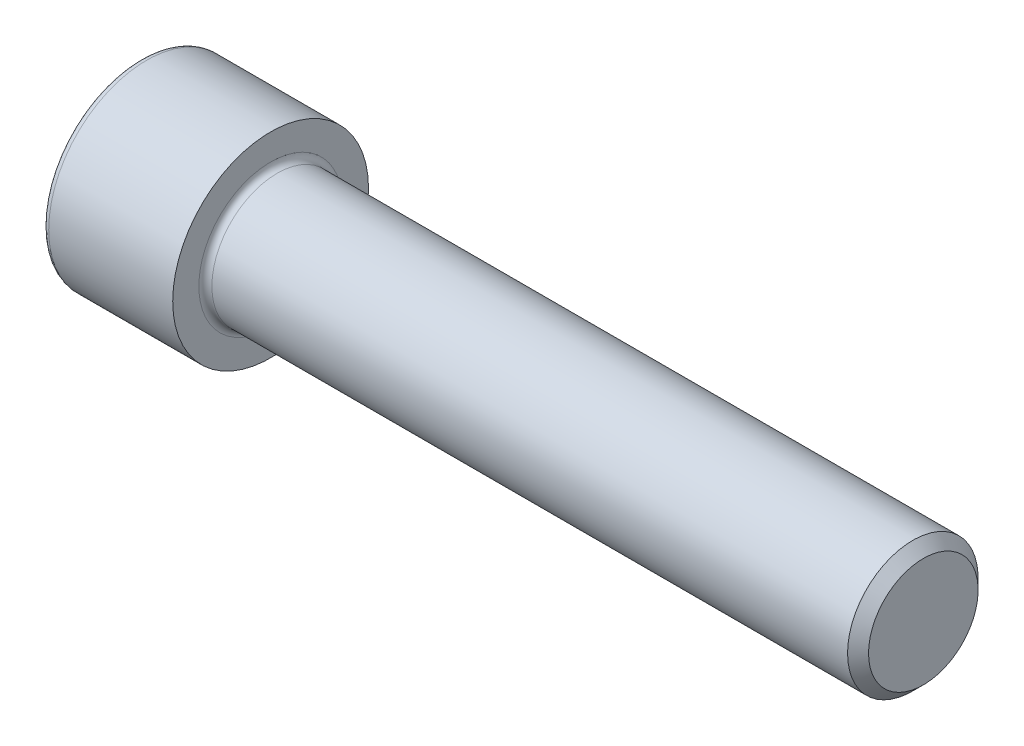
from build123d import *

# Parameters (mm, degrees)
FILLET1_R   = 0.6
FILLET2_R   = 0.6
HEX_2_DEPTH = 6


with BuildPart() as part:
    # BodySke → Base-Revolve (revolve)
    with BuildSketch(Plane.XY, mode=Mode.PRIVATE) as base_revolve_sk:
        Polygon((0, 0), (0, 9), (12, 9), (12, 6), (71.036, 6), (72, 5.036), (72, 0), align=None)
    revolve(base_revolve_sk.sketch.rotate(Axis((-31.75, 0, 0), (1, 0, 0)), 90), axis=Axis((-31.75, 0, 0), (1, 0, 0)))

    # Fillet1
    fillet1_edges = [part.edges().sort_by_distance(p)[0] for p in [
        (12, 0, -6),
    ]]
    fillet(fillet1_edges, radius=FILLET1_R)

    # Fillet2
    fillet2_edges = [part.edges().sort_by_distance(p)[0] for p in [
        (0, 0, -9),
    ]]
    fillet(fillet2_edges, radius=FILLET2_R)

    # Sketch2 → Hex-PreBroach (revolve, cut)
    with BuildSketch(Plane.XY, mode=Mode.PRIVATE) as hex_prebroach_sk:
        Polygon((0, 5.0575), (6, 5.0575), (8.919948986, 0), (0, 0), align=None)
    revolve(hex_prebroach_sk.sketch.rotate(Axis((0, 0, 0), (1, 0, 0)), 90), axis=Axis((0, 0, 0), (1, 0, 0)), mode=Mode.SUBTRACT)

    # Sketch3 → Hex 2 (cut)
    with BuildSketch(Plane(origin=(0, 0, 0), x_dir=(0, 0.500000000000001, 0.866025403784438), z_dir=(-1, 0, 0))):
        Polygon((2.919948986, 5.0575), (-2.919948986, 5.0575), (-5.839897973, 0), (-2.919948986, -5.0575), (2.919948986, -5.0575), (5.839897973, 0), align=None)
    extrude(amount=-HEX_2_DEPTH, mode=Mode.SUBTRACT)


solid = part.part
